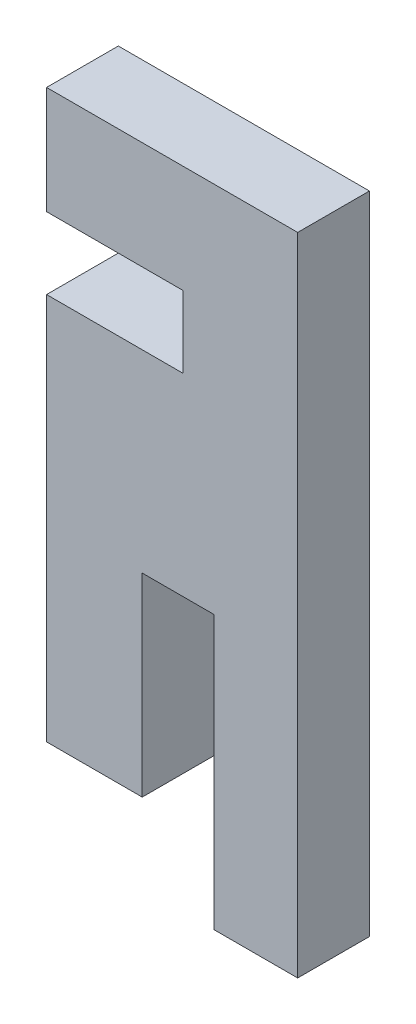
from build123d import *

# Parameters (mm, degrees)
BOSS_EXTRUDE1_DEPTH = 3


with BuildPart() as part:
    # Sketch1 → Boss-Extrude1 (new body)
    with BuildSketch(Plane.XY):
        Polygon((-5.25, 9), (-5.25, 13.5), (5.25, 13.5), (5.25, -13.5), (1.75, -13.5), (1.75, -2.085570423), (-1.25, -2.085570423), (-1.25, -10.2), (-5.25, -10.2), (-5.25, 6), (0.45, 6), (0.45, 9), align=None)
    extrude(amount=BOSS_EXTRUDE1_DEPTH)


solid = part.part
